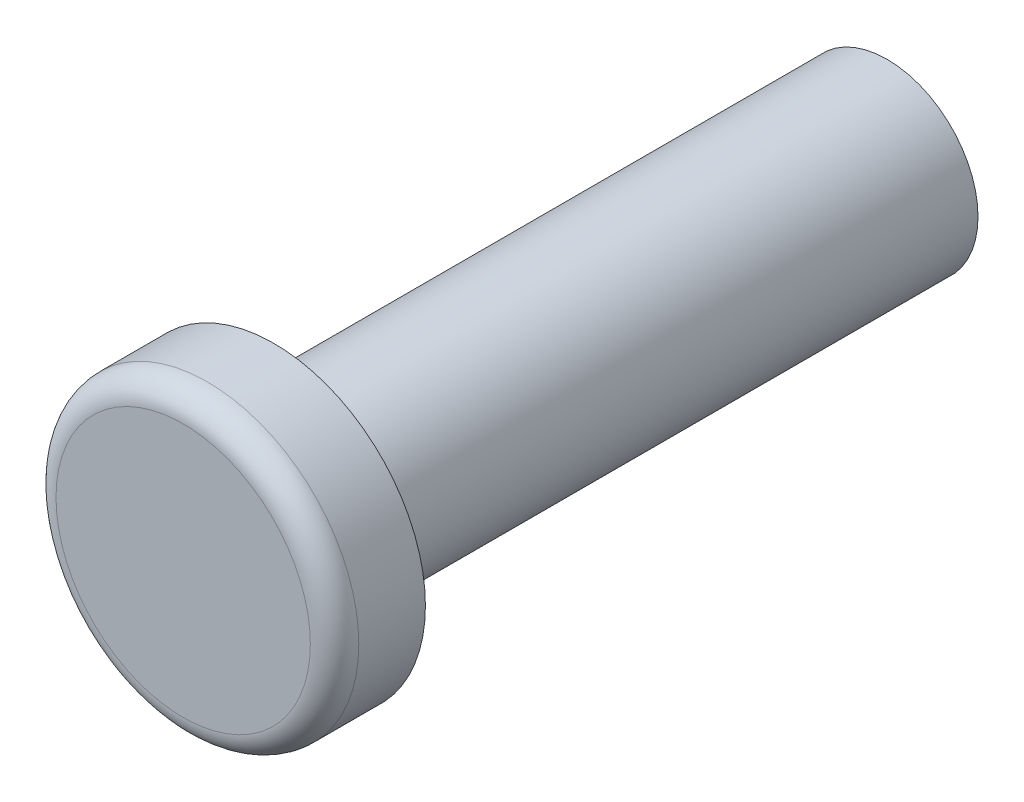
ISO-10303-21;
HEADER;
FILE_DESCRIPTION(('STEP AP214'),'2;1');
FILE_NAME('part.step','',(''),(''),'','','');
FILE_SCHEMA(('AUTOMOTIVE_DESIGN { 1 0 10303 214 1 1 1 1 }'));
ENDSEC;
DATA;
#1=APPLICATION_CONTEXT('core data for automotive mechanical design processes');
#2=APPLICATION_PROTOCOL_DEFINITION('international standard','automotive_design',2000,#1);
#3=PRODUCT_CONTEXT('',#1,'mechanical');
#4=PRODUCT('Part','Part','',(#3));
#5=PRODUCT_RELATED_PRODUCT_CATEGORY('part','',(#4));
#6=PRODUCT_DEFINITION_FORMATION('','',#4);
#7=PRODUCT_DEFINITION_CONTEXT('part definition',#1,'design');
#8=PRODUCT_DEFINITION('design','',#6,#7);
#9=PRODUCT_DEFINITION_SHAPE('','',#8);
#10=(LENGTH_UNIT() NAMED_UNIT(*) SI_UNIT(.MILLI.,.METRE.));
#11=(NAMED_UNIT(*) PLANE_ANGLE_UNIT() SI_UNIT($,.RADIAN.));
#12=(NAMED_UNIT(*) SI_UNIT($,.STERADIAN.) SOLID_ANGLE_UNIT());
#13=UNCERTAINTY_MEASURE_WITH_UNIT(LENGTH_MEASURE(1.E-05),#10,'distance_accuracy_value','');
#14=(GEOMETRIC_REPRESENTATION_CONTEXT(3) GLOBAL_UNCERTAINTY_ASSIGNED_CONTEXT((#13)) GLOBAL_UNIT_ASSIGNED_CONTEXT((#10,
#11,#12)) REPRESENTATION_CONTEXT('',''));
#15=CARTESIAN_POINT('',(0.,0.,0.));
#16=DIRECTION('',(0.,0.,1.));
#17=DIRECTION('',(1.,0.,0.));
#18=AXIS2_PLACEMENT_3D('',#15,#16,#17);
#19=CARTESIAN_POINT('',(0.,0.,0.));
#20=DIRECTION('',(0.,0.,1.));
#21=DIRECTION('',(1.,0.,0.));
#22=AXIS2_PLACEMENT_3D('',#19,#20,#21);
#23=PLANE('',#22);
#24=CARTESIAN_POINT('',(0.,0.,0.));
#25=DIRECTION('',(0.,0.,1.));
#26=DIRECTION('',(1.,0.,0.));
#27=AXIS2_PLACEMENT_3D('',#24,#25,#26);
#28=CIRCLE('',#27,5.);
#29=CARTESIAN_POINT('',(5.,0.,0.));
#30=VERTEX_POINT('',#29);
#31=EDGE_CURVE('E44',#30,#30,#28,.T.);
#32=ORIENTED_EDGE('',*,*,#31,.F.);
#33=EDGE_LOOP('',(#32));
#34=FACE_BOUND('',#33,.T.);
#35=CARTESIAN_POINT('',(0.,0.,0.));
#36=DIRECTION('',(0.,0.,1.));
#37=DIRECTION('',(1.,0.,0.));
#38=AXIS2_PLACEMENT_3D('',#35,#36,#37);
#39=CIRCLE('',#38,3.);
#40=CARTESIAN_POINT('',(3.,0.,0.));
#41=VERTEX_POINT('',#40);
#42=EDGE_CURVE('E40',#41,#41,#39,.F.);
#43=ORIENTED_EDGE('',*,*,#42,.F.);
#44=EDGE_LOOP('',(#43));
#45=FACE_BOUND('',#44,.T.);
#46=ADVANCED_FACE('F29',(#34,#45),#23,.F.);
#47=CARTESIAN_POINT('',(0.,0.,3.));
#48=DIRECTION('',(0.,0.,-1.));
#49=DIRECTION('',(-1.,0.,0.));
#50=AXIS2_PLACEMENT_3D('',#47,#48,#49);
#51=CYLINDRICAL_SURFACE('',#50,5.);
#52=CARTESIAN_POINT('',(0.,0.,2.2));
#53=DIRECTION('',(0.,0.,1.));
#54=DIRECTION('',(1.,0.,0.));
#55=AXIS2_PLACEMENT_3D('',#52,#53,#54);
#56=CIRCLE('',#55,5.);
#57=CARTESIAN_POINT('',(5.,0.,2.2));
#58=VERTEX_POINT('',#57);
#59=EDGE_CURVE('E10',#58,#58,#56,.F.);
#60=ORIENTED_EDGE('',*,*,#59,.T.);
#61=EDGE_LOOP('',(#60));
#62=FACE_BOUND('',#61,.T.);
#63=ORIENTED_EDGE('',*,*,#31,.T.);
#64=EDGE_LOOP('',(#63));
#65=FACE_BOUND('',#64,.T.);
#66=ADVANCED_FACE('F63',(#62,#65),#51,.T.);
#67=CARTESIAN_POINT('',(0.,0.,3.));
#68=DIRECTION('',(0.,0.,1.));
#69=DIRECTION('',(1.,0.,0.));
#70=AXIS2_PLACEMENT_3D('',#67,#68,#69);
#71=PLANE('',#70);
#72=CARTESIAN_POINT('',(0.,0.,3.));
#73=DIRECTION('',(0.,0.,1.));
#74=DIRECTION('',(1.,0.,0.));
#75=AXIS2_PLACEMENT_3D('',#72,#73,#74);
#76=CIRCLE('',#75,4.2);
#77=CARTESIAN_POINT('',(4.2,0.,3.));
#78=VERTEX_POINT('',#77);
#79=EDGE_CURVE('E36',#78,#78,#76,.T.);
#80=ORIENTED_EDGE('',*,*,#79,.T.);
#81=EDGE_LOOP('',(#80));
#82=FACE_BOUND('',#81,.T.);
#83=ADVANCED_FACE('F58',(#82),#71,.T.);
#84=CARTESIAN_POINT('',(0.,0.,-20.25));
#85=DIRECTION('',(0.,0.,1.));
#86=DIRECTION('',(1.,0.,0.));
#87=AXIS2_PLACEMENT_3D('',#84,#85,#86);
#88=CYLINDRICAL_SURFACE('',#87,3.);
#89=CARTESIAN_POINT('',(0.,0.,-20.25));
#90=DIRECTION('',(0.,0.,-1.));
#91=DIRECTION('',(-1.,0.,0.));
#92=AXIS2_PLACEMENT_3D('',#89,#90,#91);
#93=CIRCLE('',#92,3.);
#94=CARTESIAN_POINT('',(-3.,0.,-20.25));
#95=VERTEX_POINT('',#94);
#96=EDGE_CURVE('E49',#95,#95,#93,.T.);
#97=ORIENTED_EDGE('',*,*,#96,.F.);
#98=EDGE_LOOP('',(#97));
#99=FACE_BOUND('',#98,.T.);
#100=ORIENTED_EDGE('',*,*,#42,.T.);
#101=EDGE_LOOP('',(#100));
#102=FACE_BOUND('',#101,.T.);
#103=ADVANCED_FACE('F55',(#99,#102),#88,.T.);
#104=CARTESIAN_POINT('',(0.,0.,-20.25));
#105=DIRECTION('',(0.,0.,-1.));
#106=DIRECTION('',(-1.,0.,0.));
#107=AXIS2_PLACEMENT_3D('',#104,#105,#106);
#108=PLANE('',#107);
#109=ORIENTED_EDGE('',*,*,#96,.T.);
#110=EDGE_LOOP('',(#109));
#111=FACE_BOUND('',#110,.T.);
#112=ADVANCED_FACE('F53',(#111),#108,.T.);
#113=CARTESIAN_POINT('',(0.,0.,2.2));
#114=DIRECTION('',(0.,0.,1.));
#115=DIRECTION('',(1.,0.,0.));
#116=AXIS2_PLACEMENT_3D('',#113,#114,#115);
#117=TOROIDAL_SURFACE('',#116,4.2,0.8);
#118=ORIENTED_EDGE('',*,*,#59,.F.);
#119=EDGE_LOOP('',(#118));
#120=FACE_BOUND('',#119,.T.);
#121=ORIENTED_EDGE('',*,*,#79,.F.);
#122=EDGE_LOOP('',(#121));
#123=FACE_BOUND('',#122,.T.);
#124=ADVANCED_FACE('F31',(#120,#123),#117,.T.);
#125=CLOSED_SHELL('',(#46,#66,#83,#103,#112,#124));
#126=MANIFOLD_SOLID_BREP('B2',#125);
#127=ADVANCED_BREP_SHAPE_REPRESENTATION('',(#18,#126),#14);
#128=SHAPE_DEFINITION_REPRESENTATION(#9,#127);
ENDSEC;
END-ISO-10303-21;
